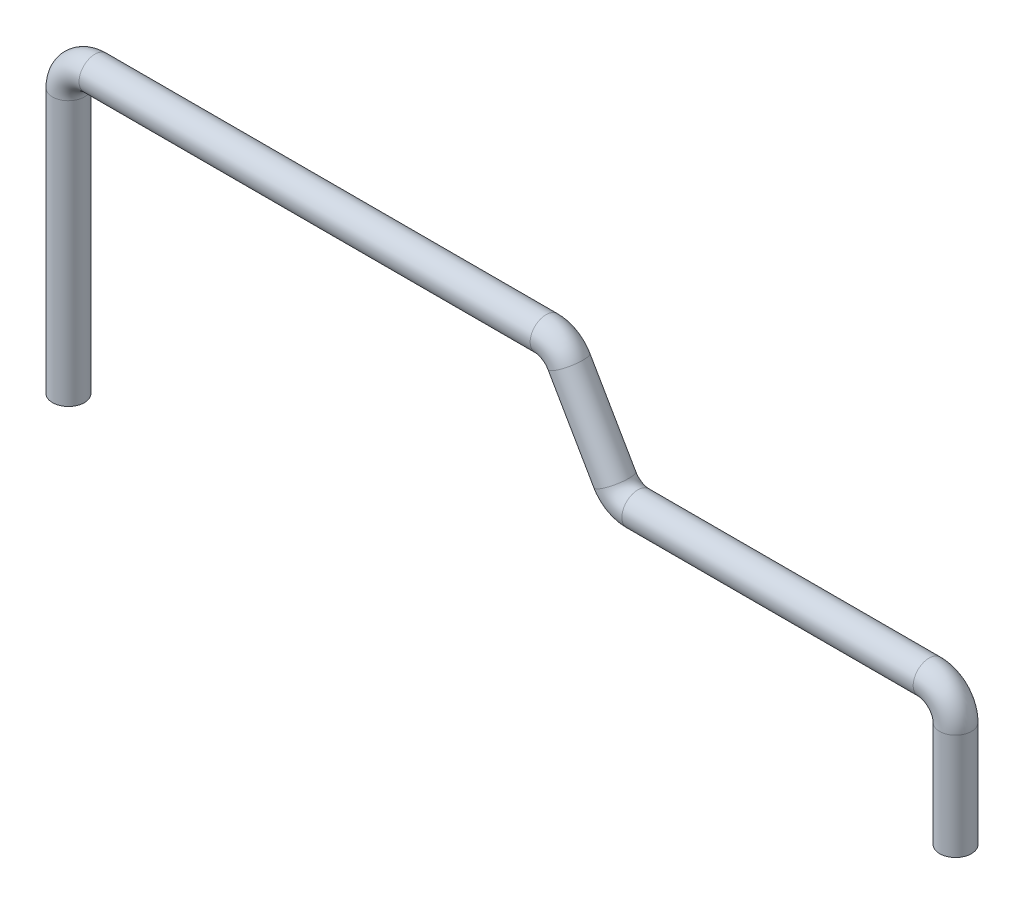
ISO-10303-21;
HEADER;
FILE_DESCRIPTION(('STEP AP214'),'2;1');
FILE_NAME('part.step','',(''),(''),'','','');
FILE_SCHEMA(('AUTOMOTIVE_DESIGN { 1 0 10303 214 1 1 1 1 }'));
ENDSEC;
DATA;
#1=APPLICATION_CONTEXT('core data for automotive mechanical design processes');
#2=APPLICATION_PROTOCOL_DEFINITION('international standard','automotive_design',2000,#1);
#3=PRODUCT_CONTEXT('',#1,'mechanical');
#4=PRODUCT('Part','Part','',(#3));
#5=PRODUCT_RELATED_PRODUCT_CATEGORY('part','',(#4));
#6=PRODUCT_DEFINITION_FORMATION('','',#4);
#7=PRODUCT_DEFINITION_CONTEXT('part definition',#1,'design');
#8=PRODUCT_DEFINITION('design','',#6,#7);
#9=PRODUCT_DEFINITION_SHAPE('','',#8);
#10=(LENGTH_UNIT() NAMED_UNIT(*) SI_UNIT(.MILLI.,.METRE.));
#11=(NAMED_UNIT(*) PLANE_ANGLE_UNIT() SI_UNIT($,.RADIAN.));
#12=(NAMED_UNIT(*) SI_UNIT($,.STERADIAN.) SOLID_ANGLE_UNIT());
#13=UNCERTAINTY_MEASURE_WITH_UNIT(LENGTH_MEASURE(1.E-05),#10,'distance_accuracy_value','');
#14=(GEOMETRIC_REPRESENTATION_CONTEXT(3) GLOBAL_UNCERTAINTY_ASSIGNED_CONTEXT((#13)) GLOBAL_UNIT_ASSIGNED_CONTEXT((#10,
#11,#12)) REPRESENTATION_CONTEXT('',''));
#15=CARTESIAN_POINT('',(0.,0.,0.));
#16=DIRECTION('',(0.,0.,1.));
#17=DIRECTION('',(1.,0.,0.));
#18=AXIS2_PLACEMENT_3D('',#15,#16,#17);
#19=CARTESIAN_POINT('',(33.5,6.,0.));
#20=DIRECTION('',(0.,-1.,0.));
#21=DIRECTION('',(0.,0.,-1.));
#22=AXIS2_PLACEMENT_3D('',#19,#20,#21);
#23=CYLINDRICAL_SURFACE('',#22,0.6);
#24=CARTESIAN_POINT('',(33.5,6.,0.));
#25=DIRECTION('',(0.,-1.,0.));
#26=DIRECTION('',(0.,0.,1.));
#27=AXIS2_PLACEMENT_3D('',#24,#25,#26);
#28=CIRCLE('',#27,0.6);
#29=CARTESIAN_POINT('',(34.1,6.,0.));
#30=VERTEX_POINT('',#29);
#31=EDGE_CURVE('E36',#30,#30,#28,.T.);
#32=ORIENTED_EDGE('',*,*,#31,.T.);
#33=EDGE_LOOP('',(#32));
#34=FACE_BOUND('',#33,.T.);
#35=CARTESIAN_POINT('',(33.5,2.,0.));
#36=DIRECTION('',(0.,-1.,0.));
#37=DIRECTION('',(0.,0.,1.));
#38=AXIS2_PLACEMENT_3D('',#35,#36,#37);
#39=CIRCLE('',#38,0.6);
#40=CARTESIAN_POINT('',(33.5,2.,0.6));
#41=VERTEX_POINT('',#40);
#42=EDGE_CURVE('E10',#41,#41,#39,.T.);
#43=ORIENTED_EDGE('',*,*,#42,.F.);
#44=EDGE_LOOP('',(#43));
#45=FACE_BOUND('',#44,.T.);
#46=ADVANCED_FACE('F30',(#34,#45),#23,.T.);
#47=CARTESIAN_POINT('',(32.5,6.,0.));
#48=DIRECTION('',(0.,0.,-1.));
#49=DIRECTION('',(-1.,0.,0.));
#50=AXIS2_PLACEMENT_3D('',#47,#48,#49);
#51=TOROIDAL_SURFACE('',#50,0.999999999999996,0.6);
#52=CARTESIAN_POINT('',(32.5,6.99999999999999,0.));
#53=DIRECTION('',(1.,0.,0.));
#54=DIRECTION('',(0.,0.,1.));
#55=AXIS2_PLACEMENT_3D('',#52,#53,#54);
#56=CIRCLE('',#55,0.6);
#57=CARTESIAN_POINT('',(32.5,7.6,0.));
#58=VERTEX_POINT('',#57);
#59=EDGE_CURVE('E40',#58,#58,#56,.T.);
#60=CARTESIAN_POINT('',(32.5,6.,0.));
#61=DIRECTION('',(0.,0.,-1.));
#62=DIRECTION('',(-1.,0.,0.));
#63=AXIS2_PLACEMENT_3D('',#60,#61,#62);
#64=CIRCLE('',#63,1.6);
#65=EDGE_CURVE('',#58,#30,#64,.T.);
#66=ORIENTED_EDGE('',*,*,#59,.T.);
#67=ORIENTED_EDGE('',*,*,#31,.F.);
#68=ORIENTED_EDGE('',*,*,#65,.T.);
#69=ORIENTED_EDGE('',*,*,#65,.F.);
#70=EDGE_LOOP('',(#66,#68,#67,#69));
#71=FACE_BOUND('',#70,.T.);
#72=ADVANCED_FACE('F86',(#71),#51,.T.);
#73=CARTESIAN_POINT('',(21.5,7.,0.));
#74=DIRECTION('',(1.,0.,0.));
#75=DIRECTION('',(0.,1.,0.));
#76=AXIS2_PLACEMENT_3D('',#73,#74,#75);
#77=CYLINDRICAL_SURFACE('',#76,0.6);
#78=CARTESIAN_POINT('',(21.5,7.,0.));
#79=DIRECTION('',(1.,0.,0.));
#80=DIRECTION('',(0.,0.,1.));
#81=AXIS2_PLACEMENT_3D('',#78,#79,#80);
#82=CIRCLE('',#81,0.6);
#83=CARTESIAN_POINT('',(21.5,6.4,0.));
#84=VERTEX_POINT('',#83);
#85=EDGE_CURVE('E44',#84,#84,#82,.T.);
#86=ORIENTED_EDGE('',*,*,#85,.T.);
#87=EDGE_LOOP('',(#86));
#88=FACE_BOUND('',#87,.T.);
#89=ORIENTED_EDGE('',*,*,#59,.F.);
#90=EDGE_LOOP('',(#89));
#91=FACE_BOUND('',#90,.T.);
#92=ADVANCED_FACE('F90',(#88,#91),#77,.T.);
#93=CARTESIAN_POINT('',(21.5,8.,0.));
#94=DIRECTION('',(0.,0.,1.));
#95=DIRECTION('',(1.,0.,0.));
#96=AXIS2_PLACEMENT_3D('',#93,#94,#95);
#97=TOROIDAL_SURFACE('',#96,1.,0.6);
#98=CARTESIAN_POINT('',(20.6339745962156,7.5,0.));
#99=DIRECTION('',(0.500000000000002,-0.866025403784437,0.));
#100=DIRECTION('',(0.,0.,1.));
#101=AXIS2_PLACEMENT_3D('',#98,#99,#100);
#102=CIRCLE('',#101,0.6);
#103=CARTESIAN_POINT('',(20.1143593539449,7.2,0.));
#104=VERTEX_POINT('',#103);
#105=EDGE_CURVE('E49',#104,#104,#102,.T.);
#106=CARTESIAN_POINT('',(21.5,8.,0.));
#107=DIRECTION('',(0.,0.,1.));
#108=DIRECTION('',(1.,0.,0.));
#109=AXIS2_PLACEMENT_3D('',#106,#107,#108);
#110=CIRCLE('',#109,1.6);
#111=EDGE_CURVE('',#104,#84,#110,.T.);
#112=ORIENTED_EDGE('',*,*,#105,.T.);
#113=ORIENTED_EDGE('',*,*,#85,.F.);
#114=ORIENTED_EDGE('',*,*,#111,.T.);
#115=ORIENTED_EDGE('',*,*,#111,.F.);
#116=EDGE_LOOP('',(#112,#114,#113,#115));
#117=FACE_BOUND('',#116,.T.);
#118=ADVANCED_FACE('F96',(#117),#97,.T.);
#119=CARTESIAN_POINT('',(18.9019237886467,10.5,0.));
#120=DIRECTION('',(0.500000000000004,-0.866025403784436,0.));
#121=DIRECTION('',(0.866025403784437,0.500000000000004,0.));
#122=AXIS2_PLACEMENT_3D('',#119,#120,#121);
#123=CYLINDRICAL_SURFACE('',#122,0.6);
#124=CARTESIAN_POINT('',(18.9019237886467,10.5,0.));
#125=DIRECTION('',(0.500000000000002,-0.866025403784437,0.));
#126=DIRECTION('',(0.,0.,1.));
#127=AXIS2_PLACEMENT_3D('',#124,#125,#126);
#128=CIRCLE('',#127,0.6);
#129=CARTESIAN_POINT('',(19.4215390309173,10.8,0.));
#130=VERTEX_POINT('',#129);
#131=EDGE_CURVE('E52',#130,#130,#128,.T.);
#132=ORIENTED_EDGE('',*,*,#131,.T.);
#133=EDGE_LOOP('',(#132));
#134=FACE_BOUND('',#133,.T.);
#135=ORIENTED_EDGE('',*,*,#105,.F.);
#136=EDGE_LOOP('',(#135));
#137=FACE_BOUND('',#136,.T.);
#138=ADVANCED_FACE('F103',(#134,#137),#123,.T.);
#139=CARTESIAN_POINT('',(18.0358983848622,10.,0.));
#140=DIRECTION('',(0.,0.,-1.));
#141=DIRECTION('',(-1.,0.,0.));
#142=AXIS2_PLACEMENT_3D('',#139,#140,#141);
#143=TOROIDAL_SURFACE('',#142,0.999999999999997,0.6);
#144=CARTESIAN_POINT('',(18.0358983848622,11.,0.));
#145=DIRECTION('',(1.,0.,0.));
#146=DIRECTION('',(0.,0.,1.));
#147=AXIS2_PLACEMENT_3D('',#144,#145,#146);
#148=CIRCLE('',#147,0.6);
#149=CARTESIAN_POINT('',(18.0358983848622,11.6,0.));
#150=VERTEX_POINT('',#149);
#151=EDGE_CURVE('E55',#150,#150,#148,.T.);
#152=CARTESIAN_POINT('',(18.0358983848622,10.,0.));
#153=DIRECTION('',(0.,0.,-1.));
#154=DIRECTION('',(-1.,0.,0.));
#155=AXIS2_PLACEMENT_3D('',#152,#153,#154);
#156=CIRCLE('',#155,1.6);
#157=EDGE_CURVE('',#150,#130,#156,.T.);
#158=ORIENTED_EDGE('',*,*,#151,.T.);
#159=ORIENTED_EDGE('',*,*,#131,.F.);
#160=ORIENTED_EDGE('',*,*,#157,.T.);
#161=ORIENTED_EDGE('',*,*,#157,.F.);
#162=EDGE_LOOP('',(#158,#160,#159,#161));
#163=FACE_BOUND('',#162,.T.);
#164=ADVANCED_FACE('F107',(#163),#143,.T.);
#165=CARTESIAN_POINT('',(0.999999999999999,11.,0.));
#166=DIRECTION('',(1.,0.,0.));
#167=DIRECTION('',(0.,0.,-1.));
#168=AXIS2_PLACEMENT_3D('',#165,#166,#167);
#169=CYLINDRICAL_SURFACE('',#168,0.6);
#170=CARTESIAN_POINT('',(0.999999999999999,11.,0.));
#171=DIRECTION('',(1.,0.,0.));
#172=DIRECTION('',(0.,0.,1.));
#173=AXIS2_PLACEMENT_3D('',#170,#171,#172);
#174=CIRCLE('',#173,0.6);
#175=CARTESIAN_POINT('',(0.999999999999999,11.6,0.));
#176=VERTEX_POINT('',#175);
#177=EDGE_CURVE('E58',#176,#176,#174,.T.);
#178=ORIENTED_EDGE('',*,*,#177,.T.);
#179=EDGE_LOOP('',(#178));
#180=FACE_BOUND('',#179,.T.);
#181=ORIENTED_EDGE('',*,*,#151,.F.);
#182=EDGE_LOOP('',(#181));
#183=FACE_BOUND('',#182,.T.);
#184=ADVANCED_FACE('F111',(#180,#183),#169,.T.);
#185=CARTESIAN_POINT('',(1.,10.,0.));
#186=DIRECTION('',(0.,0.,-1.));
#187=DIRECTION('',(-1.,0.,0.));
#188=AXIS2_PLACEMENT_3D('',#185,#186,#187);
#189=TOROIDAL_SURFACE('',#188,1.,0.6);
#190=CARTESIAN_POINT('',(0.,10.,0.));
#191=DIRECTION('',(0.,1.,0.));
#192=DIRECTION('',(0.,0.,1.));
#193=AXIS2_PLACEMENT_3D('',#190,#191,#192);
#194=CIRCLE('',#193,0.6);
#195=CARTESIAN_POINT('',(-0.6,10.,0.));
#196=VERTEX_POINT('',#195);
#197=EDGE_CURVE('E61',#196,#196,#194,.T.);
#198=CARTESIAN_POINT('',(1.,10.,0.));
#199=DIRECTION('',(0.,0.,-1.));
#200=DIRECTION('',(-1.,0.,0.));
#201=AXIS2_PLACEMENT_3D('',#198,#199,#200);
#202=CIRCLE('',#201,1.6);
#203=EDGE_CURVE('',#196,#176,#202,.T.);
#204=ORIENTED_EDGE('',*,*,#197,.T.);
#205=ORIENTED_EDGE('',*,*,#177,.F.);
#206=ORIENTED_EDGE('',*,*,#203,.T.);
#207=ORIENTED_EDGE('',*,*,#203,.F.);
#208=EDGE_LOOP('',(#204,#206,#205,#207));
#209=FACE_BOUND('',#208,.T.);
#210=ADVANCED_FACE('F68',(#209),#189,.T.);
#211=CARTESIAN_POINT('',(0.,10.,0.));
#212=DIRECTION('',(0.,-1.,0.));
#213=DIRECTION('',(0.,0.,-1.));
#214=AXIS2_PLACEMENT_3D('',#211,#212,#213);
#215=CYLINDRICAL_SURFACE('',#214,0.6);
#216=ORIENTED_EDGE('',*,*,#197,.F.);
#217=EDGE_LOOP('',(#216));
#218=FACE_BOUND('',#217,.T.);
#219=CARTESIAN_POINT('',(0.,0.,0.));
#220=DIRECTION('',(0.,1.,0.));
#221=DIRECTION('',(0.,0.,1.));
#222=AXIS2_PLACEMENT_3D('',#219,#220,#221);
#223=CIRCLE('',#222,0.6);
#224=CARTESIAN_POINT('',(0.,0.,0.6));
#225=VERTEX_POINT('',#224);
#226=EDGE_CURVE('E62',#225,#225,#223,.T.);
#227=ORIENTED_EDGE('',*,*,#226,.T.);
#228=EDGE_LOOP('',(#227));
#229=FACE_BOUND('',#228,.T.);
#230=ADVANCED_FACE('F71',(#218,#229),#215,.T.);
#231=CARTESIAN_POINT('',(33.5,2.,0.));
#232=DIRECTION('',(0.,-1.,0.));
#233=DIRECTION('',(0.,0.,1.));
#234=AXIS2_PLACEMENT_3D('',#231,#232,#233);
#235=PLANE('',#234);
#236=ORIENTED_EDGE('',*,*,#42,.T.);
#237=EDGE_LOOP('',(#236));
#238=FACE_BOUND('',#237,.T.);
#239=ADVANCED_FACE('F74',(#238),#235,.T.);
#240=CARTESIAN_POINT('',(0.,0.,0.));
#241=DIRECTION('',(0.,1.,0.));
#242=DIRECTION('',(0.,0.,1.));
#243=AXIS2_PLACEMENT_3D('',#240,#241,#242);
#244=PLANE('',#243);
#245=ORIENTED_EDGE('',*,*,#226,.F.);
#246=EDGE_LOOP('',(#245));
#247=FACE_BOUND('',#246,.T.);
#248=ADVANCED_FACE('F78',(#247),#244,.F.);
#249=CLOSED_SHELL('',(#46,#72,#92,#118,#138,#164,#184,#210,#230,#239,#248));
#250=MANIFOLD_SOLID_BREP('B2',#249);
#251=ADVANCED_BREP_SHAPE_REPRESENTATION('',(#18,#250),#14);
#252=SHAPE_DEFINITION_REPRESENTATION(#9,#251);
ENDSEC;
END-ISO-10303-21;
